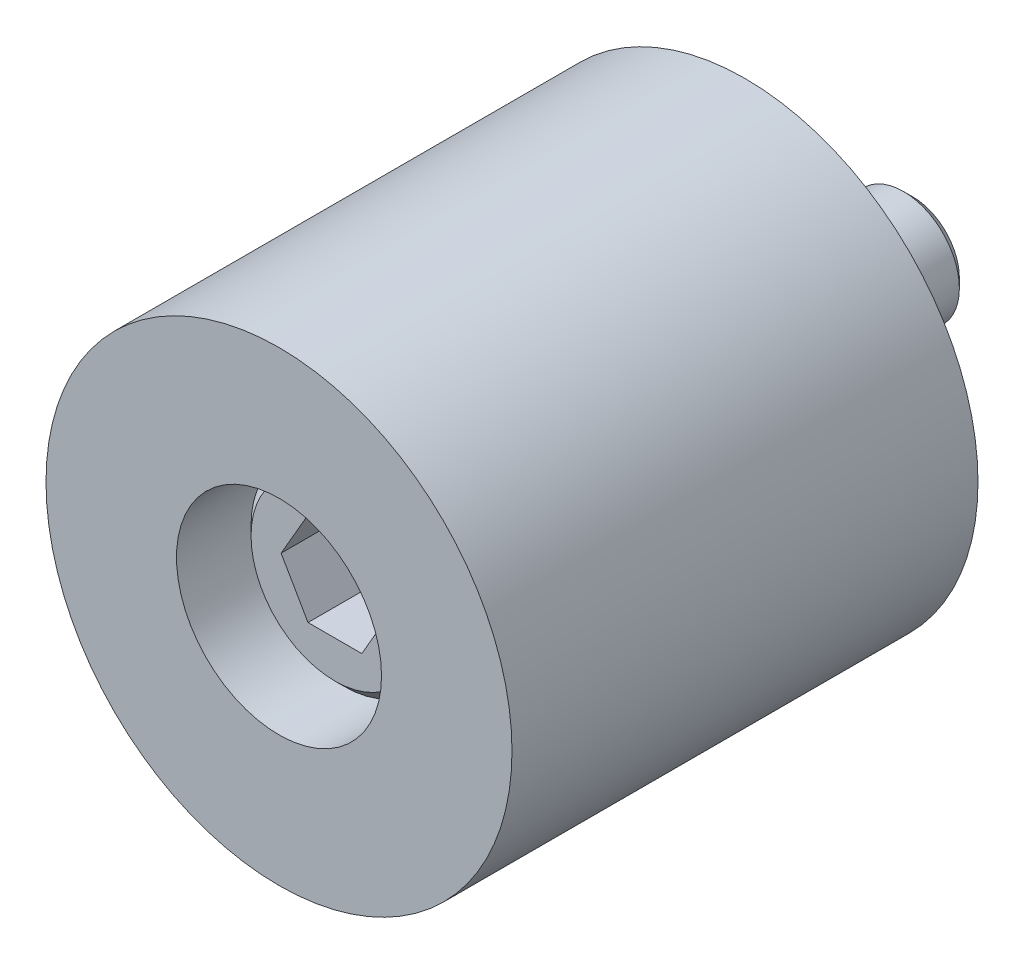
ISO-10303-21;
HEADER;
FILE_DESCRIPTION(('STEP AP214'),'2;1');
FILE_NAME('part.step','',(''),(''),'','','');
FILE_SCHEMA(('AUTOMOTIVE_DESIGN { 1 0 10303 214 1 1 1 1 }'));
ENDSEC;
DATA;
#1=APPLICATION_CONTEXT('core data for automotive mechanical design processes');
#2=APPLICATION_PROTOCOL_DEFINITION('international standard','automotive_design',2000,#1);
#3=PRODUCT_CONTEXT('',#1,'mechanical');
#4=PRODUCT('Part','Part','',(#3));
#5=PRODUCT_RELATED_PRODUCT_CATEGORY('part','',(#4));
#6=PRODUCT_DEFINITION_FORMATION('','',#4);
#7=PRODUCT_DEFINITION_CONTEXT('part definition',#1,'design');
#8=PRODUCT_DEFINITION('design','',#6,#7);
#9=PRODUCT_DEFINITION_SHAPE('','',#8);
#10=(LENGTH_UNIT() NAMED_UNIT(*) SI_UNIT(.MILLI.,.METRE.));
#11=(NAMED_UNIT(*) PLANE_ANGLE_UNIT() SI_UNIT($,.RADIAN.));
#12=(NAMED_UNIT(*) SI_UNIT($,.STERADIAN.) SOLID_ANGLE_UNIT());
#13=UNCERTAINTY_MEASURE_WITH_UNIT(LENGTH_MEASURE(1.E-05),#10,'distance_accuracy_value','');
#14=(GEOMETRIC_REPRESENTATION_CONTEXT(3) GLOBAL_UNCERTAINTY_ASSIGNED_CONTEXT((#13)) GLOBAL_UNIT_ASSIGNED_CONTEXT((#10,
#11,#12)) REPRESENTATION_CONTEXT('',''));
#15=CARTESIAN_POINT('',(0.,0.,0.));
#16=DIRECTION('',(0.,0.,1.));
#17=DIRECTION('',(1.,0.,0.));
#18=AXIS2_PLACEMENT_3D('',#15,#16,#17);
#19=CARTESIAN_POINT('',(0.,0.,12.5));
#20=DIRECTION('',(0.,0.,-1.));
#21=DIRECTION('',(1.,0.,0.));
#22=AXIS2_PLACEMENT_3D('',#19,#20,#21);
#23=CYLINDRICAL_SURFACE('',#22,3.25);
#24=CARTESIAN_POINT('',(0.,0.,16.));
#25=DIRECTION('',(0.,0.,1.));
#26=DIRECTION('',(-1.,0.,0.));
#27=AXIS2_PLACEMENT_3D('',#24,#25,#26);
#28=CIRCLE('',#27,3.25);
#29=CARTESIAN_POINT('',(-3.25,0.,16.));
#30=VERTEX_POINT('',#29);
#31=CARTESIAN_POINT('',(3.25,0.,16.));
#32=VERTEX_POINT('',#31);
#33=EDGE_CURVE('P0_E36',#30,#32,#28,.T.);
#34=ORIENTED_EDGE('',*,*,#33,.T.);
#35=CARTESIAN_POINT('',(3.25,0.,15.9999987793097));
#36=CARTESIAN_POINT('',(3.25,0.,-1.63686635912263E-06));
#37=B_SPLINE_CURVE_WITH_KNOTS('',1,(#35,#36),.UNSPECIFIED.,.F.,.F.,(2,2),(0.0833333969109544,
0.916666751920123),.UNSPECIFIED.);
#38=CARTESIAN_POINT('',(3.25,0.,0.));
#39=VERTEX_POINT('',#38);
#40=EDGE_CURVE('P0_E25',#32,#39,#37,.T.);
#41=ORIENTED_EDGE('',*,*,#40,.T.);
#42=CARTESIAN_POINT('',(0.,0.,0.));
#43=DIRECTION('',(0.,0.,1.));
#44=DIRECTION('',(1.,0.,0.));
#45=AXIS2_PLACEMENT_3D('',#42,#43,#44);
#46=CIRCLE('',#45,3.25);
#47=EDGE_CURVE('P0_E11',#39,#39,#46,.T.);
#48=ORIENTED_EDGE('',*,*,#47,.F.);
#49=ORIENTED_EDGE('',*,*,#40,.F.);
#50=CARTESIAN_POINT('',(0.,0.,16.));
#51=DIRECTION('',(0.,0.,1.));
#52=DIRECTION('',(-1.,0.,0.));
#53=AXIS2_PLACEMENT_3D('',#50,#51,#52);
#54=CIRCLE('',#53,3.25);
#55=EDGE_CURVE('P0_E51',#32,#30,#54,.T.);
#56=ORIENTED_EDGE('',*,*,#55,.T.);
#57=EDGE_LOOP('',(#34,#41,#48,#49,#56));
#58=FACE_BOUND('',#57,.T.);
#59=ADVANCED_FACE('P0_F16',(#58),#23,.F.);
#60=CARTESIAN_POINT('',(0.,0.,20.5));
#61=DIRECTION('',(0.,0.,-1.));
#62=DIRECTION('',(1.,0.,0.));
#63=AXIS2_PLACEMENT_3D('',#60,#61,#62);
#64=CYLINDRICAL_SURFACE('',#63,5.5);
#65=CARTESIAN_POINT('',(0.,0.,25.));
#66=DIRECTION('',(0.,0.,-1.));
#67=DIRECTION('',(1.,0.,0.));
#68=AXIS2_PLACEMENT_3D('',#65,#66,#67);
#69=CIRCLE('',#68,5.5);
#70=CARTESIAN_POINT('',(5.5,0.,25.));
#71=VERTEX_POINT('',#70);
#72=EDGE_CURVE('P0_E53',#71,#71,#69,.T.);
#73=ORIENTED_EDGE('',*,*,#72,.F.);
#74=CARTESIAN_POINT('',(5.5,0.,25.0000013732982));
#75=CARTESIAN_POINT('',(5.5,0.,15.9999982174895));
#76=B_SPLINE_CURVE_WITH_KNOTS('',1,(#74,#75),.UNSPECIFIED.,.F.,.F.,(2,2),(0.0833332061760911,
0.916666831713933),.UNSPECIFIED.);
#77=CARTESIAN_POINT('',(5.5,0.,16.));
#78=VERTEX_POINT('',#77);
#79=EDGE_CURVE('P0_E91',#71,#78,#76,.T.);
#80=ORIENTED_EDGE('',*,*,#79,.T.);
#81=CARTESIAN_POINT('',(0.,0.,16.));
#82=DIRECTION('',(0.,0.,-1.));
#83=DIRECTION('',(1.,0.,0.));
#84=AXIS2_PLACEMENT_3D('',#81,#82,#83);
#85=CIRCLE('',#84,5.5);
#86=EDGE_CURVE('P0_E94',#78,#78,#85,.T.);
#87=ORIENTED_EDGE('',*,*,#86,.T.);
#88=ORIENTED_EDGE('',*,*,#79,.F.);
#89=EDGE_LOOP('',(#73,#80,#87,#88));
#90=FACE_BOUND('',#89,.T.);
#91=ADVANCED_FACE('P0_F111',(#90),#64,.F.);
#92=CARTESIAN_POINT('',(-12.65,11.4315353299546,16.));
#93=DIRECTION('',(0.,0.,-1.));
#94=DIRECTION('',(1.,0.,0.));
#95=AXIS2_PLACEMENT_3D('',#92,#93,#94);
#96=PLANE('',#95);
#97=ORIENTED_EDGE('',*,*,#86,.F.);
#98=EDGE_LOOP('',(#97));
#99=FACE_BOUND('',#98,.T.);
#100=ORIENTED_EDGE('',*,*,#55,.F.);
#101=ORIENTED_EDGE('',*,*,#33,.F.);
#102=EDGE_LOOP('',(#100,#101));
#103=FACE_BOUND('',#102,.T.);
#104=ADVANCED_FACE('P0_F55',(#99,#103),#96,.F.);
#105=CARTESIAN_POINT('',(0.,0.,12.5));
#106=DIRECTION('',(0.,0.,1.));
#107=DIRECTION('',(1.,0.,0.));
#108=AXIS2_PLACEMENT_3D('',#105,#106,#107);
#109=CYLINDRICAL_SURFACE('',#108,12.5);
#110=CARTESIAN_POINT('',(0.,0.,0.));
#111=DIRECTION('',(0.,0.,-1.));
#112=DIRECTION('',(1.,0.,0.));
#113=AXIS2_PLACEMENT_3D('',#110,#111,#112);
#114=CIRCLE('',#113,12.5);
#115=CARTESIAN_POINT('',(12.5,0.,0.));
#116=VERTEX_POINT('',#115);
#117=EDGE_CURVE('P0_E85',#116,#116,#114,.T.);
#118=ORIENTED_EDGE('',*,*,#117,.F.);
#119=CARTESIAN_POINT('',(12.5,0.,-9.53694316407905E-07));
#120=CARTESIAN_POINT('',(12.5,0.,24.9999996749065));
#121=B_SPLINE_CURVE_WITH_KNOTS('',1,(#119,#120),.UNSPECIFIED.,.F.,.F.,(2,2),(0.0833333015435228,
0.916666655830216),.UNSPECIFIED.);
#122=CARTESIAN_POINT('',(12.5,0.,25.));
#123=VERTEX_POINT('',#122);
#124=EDGE_CURVE('P0_E57',#116,#123,#121,.T.);
#125=ORIENTED_EDGE('',*,*,#124,.T.);
#126=CARTESIAN_POINT('',(0.,0.,25.));
#127=DIRECTION('',(0.,0.,1.));
#128=DIRECTION('',(1.,0.,0.));
#129=AXIS2_PLACEMENT_3D('',#126,#127,#128);
#130=CIRCLE('',#129,12.5);
#131=EDGE_CURVE('P0_E82',#123,#123,#130,.T.);
#132=ORIENTED_EDGE('',*,*,#131,.F.);
#133=ORIENTED_EDGE('',*,*,#124,.F.);
#134=EDGE_LOOP('',(#118,#125,#132,#133));
#135=FACE_BOUND('',#134,.T.);
#136=ADVANCED_FACE('P0_F130',(#135),#109,.T.);
#137=CARTESIAN_POINT('',(16.25,-25.9807621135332,0.));
#138=DIRECTION('',(0.,0.,-1.));
#139=DIRECTION('',(-1.,0.,0.));
#140=AXIS2_PLACEMENT_3D('',#137,#138,#139);
#141=PLANE('',#140);
#142=ORIENTED_EDGE('',*,*,#117,.T.);
#143=EDGE_LOOP('',(#142));
#144=FACE_BOUND('',#143,.T.);
#145=ORIENTED_EDGE('',*,*,#47,.T.);
#146=EDGE_LOOP('',(#145));
#147=FACE_BOUND('',#146,.T.);
#148=ADVANCED_FACE('P0_F132',(#144,#147),#141,.T.);
#149=CARTESIAN_POINT('',(-28.75,-25.9807621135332,25.));
#150=DIRECTION('',(0.,0.,1.));
#151=DIRECTION('',(1.,0.,0.));
#152=AXIS2_PLACEMENT_3D('',#149,#150,#151);
#153=PLANE('',#152);
#154=ORIENTED_EDGE('',*,*,#131,.T.);
#155=EDGE_LOOP('',(#154));
#156=FACE_BOUND('',#155,.T.);
#157=ORIENTED_EDGE('',*,*,#72,.T.);
#158=EDGE_LOOP('',(#157));
#159=FACE_BOUND('',#158,.T.);
#160=ADVANCED_FACE('P0_F108',(#156,#159),#153,.T.);
#161=CLOSED_SHELL('',(#59,#91,#104,#136,#148,#160));
#162=MANIFOLD_SOLID_BREP('P0_B1',#161);
#163=CARTESIAN_POINT('',(0.,0.,-7.25735931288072));
#164=DIRECTION('',(0.,0.,1.));
#165=DIRECTION('',(-1.,0.,0.));
#166=AXIS2_PLACEMENT_3D('',#163,#164,#165);
#167=CONICAL_SURFACE('',#166,4.24264068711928,0.785398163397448);
#168=CARTESIAN_POINT('',(0.,0.,-9.));
#169=DIRECTION('',(0.,0.,1.));
#170=DIRECTION('',(1.,0.,0.));
#171=AXIS2_PLACEMENT_3D('',#168,#169,#170);
#172=CIRCLE('',#171,2.5);
#173=CARTESIAN_POINT('',(2.5,0.,-9.));
#174=VERTEX_POINT('',#173);
#175=CARTESIAN_POINT('',(-2.5,0.,-9.));
#176=VERTEX_POINT('',#175);
#177=EDGE_CURVE('P1_E37',#174,#176,#172,.T.);
#178=ORIENTED_EDGE('',*,*,#177,.T.);
#179=CARTESIAN_POINT('',(-2.49999945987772,0.,-9.00000054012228));
#180=CARTESIAN_POINT('',(-2.9999979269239,0.,-8.5000020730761));
#181=B_SPLINE_CURVE_WITH_KNOTS('',1,(#179,#180),.UNSPECIFIED.,.F.,.F.,(2,2),(0.589255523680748,
0.707106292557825),.UNSPECIFIED.);
#182=CARTESIAN_POINT('',(-3.,0.,-8.5));
#183=VERTEX_POINT('',#182);
#184=EDGE_CURVE('P1_E24',#176,#183,#181,.T.);
#185=ORIENTED_EDGE('',*,*,#184,.T.);
#186=CARTESIAN_POINT('',(0.,0.,-8.5));
#187=DIRECTION('',(0.,0.,-1.));
#188=DIRECTION('',(1.,0.,0.));
#189=AXIS2_PLACEMENT_3D('',#186,#187,#188);
#190=CIRCLE('',#189,3.);
#191=CARTESIAN_POINT('',(3.,0.,-8.5));
#192=VERTEX_POINT('',#191);
#193=EDGE_CURVE('P1_E173',#183,#192,#190,.T.);
#194=ORIENTED_EDGE('',*,*,#193,.T.);
#195=CARTESIAN_POINT('',(0.,0.,-8.5));
#196=DIRECTION('',(0.,0.,-1.));
#197=DIRECTION('',(1.,0.,0.));
#198=AXIS2_PLACEMENT_3D('',#195,#196,#197);
#199=CIRCLE('',#198,3.);
#200=EDGE_CURVE('P1_E10',#192,#183,#199,.T.);
#201=ORIENTED_EDGE('',*,*,#200,.T.);
#202=ORIENTED_EDGE('',*,*,#184,.F.);
#203=CARTESIAN_POINT('',(0.,0.,-9.));
#204=DIRECTION('',(0.,0.,1.));
#205=DIRECTION('',(1.,0.,0.));
#206=AXIS2_PLACEMENT_3D('',#203,#204,#205);
#207=CIRCLE('',#206,2.5);
#208=EDGE_CURVE('P1_E146',#176,#174,#207,.T.);
#209=ORIENTED_EDGE('',*,*,#208,.T.);
#210=EDGE_LOOP('',(#178,#185,#194,#201,#202,#209));
#211=FACE_BOUND('',#210,.T.);
#212=ADVANCED_FACE('P1_F15',(#211),#167,.T.);
#213=CARTESIAN_POINT('',(0.,0.,3.5));
#214=DIRECTION('',(0.,0.,-1.));
#215=DIRECTION('',(1.,0.,0.));
#216=AXIS2_PLACEMENT_3D('',#213,#214,#215);
#217=CYLINDRICAL_SURFACE('',#216,3.);
#218=CARTESIAN_POINT('',(0.,0.,16.));
#219=DIRECTION('',(0.,0.,1.));
#220=DIRECTION('',(1.,0.,0.));
#221=AXIS2_PLACEMENT_3D('',#218,#219,#220);
#222=CIRCLE('',#221,3.);
#223=CARTESIAN_POINT('',(3.,0.,16.));
#224=VERTEX_POINT('',#223);
#225=EDGE_CURVE('P1_E154',#224,#224,#222,.T.);
#226=ORIENTED_EDGE('',*,*,#225,.F.);
#227=CARTESIAN_POINT('',(3.,0.,16.0000009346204));
#228=CARTESIAN_POINT('',(3.,0.,-8.49999968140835));
#229=B_SPLINE_CURVE_WITH_KNOTS('',1,(#227,#228),.UNSPECIFIED.,.F.,.F.,(2,2),(0.0833333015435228,
0.916666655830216),.UNSPECIFIED.);
#230=EDGE_CURVE('P1_E127',#224,#192,#229,.T.);
#231=ORIENTED_EDGE('',*,*,#230,.T.);
#232=ORIENTED_EDGE('',*,*,#193,.F.);
#233=ORIENTED_EDGE('',*,*,#200,.F.);
#234=ORIENTED_EDGE('',*,*,#230,.F.);
#235=EDGE_LOOP('',(#226,#231,#232,#233,#234));
#236=FACE_BOUND('',#235,.T.);
#237=ADVANCED_FACE('P1_F337',(#236),#217,.T.);
#238=CARTESIAN_POINT('',(-5.75,5.19615242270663,-9.));
#239=DIRECTION('',(0.,0.,-1.));
#240=DIRECTION('',(1.,0.,0.));
#241=AXIS2_PLACEMENT_3D('',#238,#239,#240);
#242=PLANE('',#241);
#243=ORIENTED_EDGE('',*,*,#208,.F.);
#244=ORIENTED_EDGE('',*,*,#177,.F.);
#245=EDGE_LOOP('',(#243,#244));
#246=FACE_BOUND('',#245,.T.);
#247=ADVANCED_FACE('P1_F340',(#246),#242,.T.);
#248=CARTESIAN_POINT('',(0.,0.,19.4289321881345));
#249=DIRECTION('',(0.,0.,-1.));
#250=DIRECTION('',(-1.,0.,0.));
#251=AXIS2_PLACEMENT_3D('',#248,#249,#250);
#252=CONICAL_SURFACE('',#251,7.07106781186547,0.785398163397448);
#253=CARTESIAN_POINT('',(0.,0.,22.));
#254=DIRECTION('',(0.,0.,-1.));
#255=DIRECTION('',(1.,0.,0.));
#256=AXIS2_PLACEMENT_3D('',#253,#254,#255);
#257=CIRCLE('',#256,4.5);
#258=CARTESIAN_POINT('',(4.5,0.,22.));
#259=VERTEX_POINT('',#258);
#260=CARTESIAN_POINT('',(-4.5,0.,22.));
#261=VERTEX_POINT('',#260);
#262=EDGE_CURVE('P1_E102',#259,#261,#257,.T.);
#263=ORIENTED_EDGE('',*,*,#262,.T.);
#264=CARTESIAN_POINT('',(-4.50000215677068,0.,21.9999978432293));
#265=CARTESIAN_POINT('',(-5.00000242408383,0.,21.4999975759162));
#266=B_SPLINE_CURVE_WITH_KNOTS('',1,(#264,#265),.UNSPECIFIED.,.F.,.F.,(2,2),(0.636396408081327,
0.70710712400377),.UNSPECIFIED.);
#267=CARTESIAN_POINT('',(-5.,0.,21.5));
#268=VERTEX_POINT('',#267);
#269=EDGE_CURVE('P1_E107',#261,#268,#266,.T.);
#270=ORIENTED_EDGE('',*,*,#269,.T.);
#271=CARTESIAN_POINT('',(0.,0.,21.5));
#272=DIRECTION('',(0.,0.,1.));
#273=DIRECTION('',(1.,0.,0.));
#274=AXIS2_PLACEMENT_3D('',#271,#272,#273);
#275=CIRCLE('',#274,5.);
#276=CARTESIAN_POINT('',(5.,0.,21.5));
#277=VERTEX_POINT('',#276);
#278=EDGE_CURVE('P1_E117',#268,#277,#275,.T.);
#279=ORIENTED_EDGE('',*,*,#278,.T.);
#280=CARTESIAN_POINT('',(0.,0.,21.5));
#281=DIRECTION('',(0.,0.,1.));
#282=DIRECTION('',(1.,0.,0.));
#283=AXIS2_PLACEMENT_3D('',#280,#281,#282);
#284=CIRCLE('',#283,5.);
#285=EDGE_CURVE('P1_E119',#277,#268,#284,.T.);
#286=ORIENTED_EDGE('',*,*,#285,.T.);
#287=ORIENTED_EDGE('',*,*,#269,.F.);
#288=CARTESIAN_POINT('',(0.,0.,22.));
#289=DIRECTION('',(0.,0.,-1.));
#290=DIRECTION('',(1.,0.,0.));
#291=AXIS2_PLACEMENT_3D('',#288,#289,#290);
#292=CIRCLE('',#291,4.5);
#293=EDGE_CURVE('P1_E109',#261,#259,#292,.T.);
#294=ORIENTED_EDGE('',*,*,#293,.T.);
#295=EDGE_LOOP('',(#263,#270,#279,#286,#287,#294));
#296=FACE_BOUND('',#295,.T.);
#297=ADVANCED_FACE('P1_F104',(#296),#252,.T.);
#298=CARTESIAN_POINT('',(0.,0.,19.));
#299=DIRECTION('',(0.,0.,1.));
#300=DIRECTION('',(1.,0.,0.));
#301=AXIS2_PLACEMENT_3D('',#298,#299,#300);
#302=CYLINDRICAL_SURFACE('',#301,5.);
#303=CARTESIAN_POINT('',(0.,0.,16.));
#304=DIRECTION('',(0.,0.,-1.));
#305=DIRECTION('',(1.,0.,0.));
#306=AXIS2_PLACEMENT_3D('',#303,#304,#305);
#307=CIRCLE('',#306,5.);
#308=CARTESIAN_POINT('',(5.,0.,16.));
#309=VERTEX_POINT('',#308);
#310=EDGE_CURVE('P1_E112',#309,#309,#307,.T.);
#311=ORIENTED_EDGE('',*,*,#310,.F.);
#312=CARTESIAN_POINT('',(5.,0.,16.000004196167));
#313=CARTESIAN_POINT('',(5.,0.,21.5000028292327));
#314=B_SPLINE_CURVE_WITH_KNOTS('',1,(#312,#313),.UNSPECIFIED.,.F.,.F.,(2,2),(0.0833339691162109,
0.916667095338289),.UNSPECIFIED.);
#315=EDGE_CURVE('P1_E317',#309,#277,#314,.T.);
#316=ORIENTED_EDGE('',*,*,#315,.T.);
#317=ORIENTED_EDGE('',*,*,#278,.F.);
#318=ORIENTED_EDGE('',*,*,#285,.F.);
#319=ORIENTED_EDGE('',*,*,#315,.F.);
#320=EDGE_LOOP('',(#311,#316,#317,#318,#319));
#321=FACE_BOUND('',#320,.T.);
#322=ADVANCED_FACE('P1_F348',(#321),#302,.T.);
#323=CARTESIAN_POINT('',(-10.35,-9.35307436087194,22.));
#324=DIRECTION('',(0.,0.,1.));
#325=DIRECTION('',(1.,0.,0.));
#326=AXIS2_PLACEMENT_3D('',#323,#324,#325);
#327=PLANE('',#326);
#328=ORIENTED_EDGE('',*,*,#293,.F.);
#329=ORIENTED_EDGE('',*,*,#262,.F.);
#330=EDGE_LOOP('',(#328,#329));
#331=FACE_BOUND('',#330,.T.);
#332=DIRECTION('',(-0.500000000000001,0.866025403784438,0.));
#333=VECTOR('',#332,1.);
#334=CARTESIAN_POINT('',(-1.44337567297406,-2.5,22.));
#335=LINE('',#334,#333);
#336=CARTESIAN_POINT('',(-1.44337567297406,-2.5,22.));
#337=VERTEX_POINT('',#336);
#338=CARTESIAN_POINT('',(-2.88675134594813,0.,22.));
#339=VERTEX_POINT('',#338);
#340=EDGE_CURVE('P1_E312',#337,#339,#335,.T.);
#341=ORIENTED_EDGE('',*,*,#340,.T.);
#342=DIRECTION('',(0.5,0.866025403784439,0.));
#343=VECTOR('',#342,1.);
#344=CARTESIAN_POINT('',(-2.88675134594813,0.,22.));
#345=LINE('',#344,#343);
#346=CARTESIAN_POINT('',(-1.44337567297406,2.5,22.));
#347=VERTEX_POINT('',#346);
#348=EDGE_CURVE('P1_E306',#339,#347,#345,.T.);
#349=ORIENTED_EDGE('',*,*,#348,.T.);
#350=DIRECTION('',(1.,0.,0.));
#351=VECTOR('',#350,1.);
#352=CARTESIAN_POINT('',(-1.44337567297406,2.5,22.));
#353=LINE('',#352,#351);
#354=CARTESIAN_POINT('',(1.44337567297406,2.5,22.));
#355=VERTEX_POINT('',#354);
#356=EDGE_CURVE('P1_E300',#347,#355,#353,.T.);
#357=ORIENTED_EDGE('',*,*,#356,.T.);
#358=DIRECTION('',(0.500000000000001,-0.866025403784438,0.));
#359=VECTOR('',#358,1.);
#360=CARTESIAN_POINT('',(1.44337567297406,2.5,22.));
#361=LINE('',#360,#359);
#362=CARTESIAN_POINT('',(2.88675134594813,0.,22.));
#363=VERTEX_POINT('',#362);
#364=EDGE_CURVE('P1_E294',#355,#363,#361,.T.);
#365=ORIENTED_EDGE('',*,*,#364,.T.);
#366=DIRECTION('',(-0.499999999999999,-0.866025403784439,0.));
#367=VECTOR('',#366,1.);
#368=CARTESIAN_POINT('',(2.88675134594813,0.,22.));
#369=LINE('',#368,#367);
#370=CARTESIAN_POINT('',(1.44337567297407,-2.5,22.));
#371=VERTEX_POINT('',#370);
#372=EDGE_CURVE('P1_E288',#363,#371,#369,.T.);
#373=ORIENTED_EDGE('',*,*,#372,.T.);
#374=DIRECTION('',(-1.,0.,0.));
#375=VECTOR('',#374,1.);
#376=CARTESIAN_POINT('',(1.44337567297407,-2.5,22.));
#377=LINE('',#376,#375);
#378=EDGE_CURVE('P1_E277',#371,#337,#377,.T.);
#379=ORIENTED_EDGE('',*,*,#378,.T.);
#380=EDGE_LOOP('',(#341,#349,#357,#365,#373,#379));
#381=FACE_BOUND('',#380,.T.);
#382=ADVANCED_FACE('P1_F114',(#331,#381),#327,.T.);
#383=CARTESIAN_POINT('',(0.,0.,19.5600391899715));
#384=DIRECTION('',(0.,0.,1.));
#385=DIRECTION('',(-1.,0.,0.));
#386=AXIS2_PLACEMENT_3D('',#383,#384,#385);
#387=CONICAL_SURFACE('',#386,3.81881307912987,1.02974425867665);
#388=CARTESIAN_POINT('',(0.,0.,17.275464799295));
#389=DIRECTION('',(0.,0.,-1.));
#390=DIRECTION('',(-1.,0.,0.));
#391=AXIS2_PLACEMENT_3D('',#388,#389,#390);
#392=CIRCLE('',#391,0.0166427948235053);
#393=CARTESIAN_POINT('',(-0.0166427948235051,0.,17.275464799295));
#394=VERTEX_POINT('',#393);
#395=EDGE_CURVE('P1_E216',#394,#394,#392,.T.);
#396=ORIENTED_EDGE('',*,*,#395,.T.);
#397=CARTESIAN_POINT('',(-0.0166398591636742,0.,17.2754630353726));
#398=CARTESIAN_POINT('',(-2.88675167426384,0.,19.000000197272));
#399=B_SPLINE_CURVE_WITH_KNOTS('',1,(#397,#398),.UNSPECIFIED.,.F.,.F.,(2,2),(0.0043573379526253,
0.755929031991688),.UNSPECIFIED.);
#400=CARTESIAN_POINT('',(-2.88675134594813,0.,19.));
#401=VERTEX_POINT('',#400);
#402=EDGE_CURVE('P1_E221',#394,#401,#399,.T.);
#403=ORIENTED_EDGE('',*,*,#402,.T.);
#404=CARTESIAN_POINT('',(-2.88675134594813,0.,19.));
#405=CARTESIAN_POINT('',(-2.1650635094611,-1.25,18.5663661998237));
#406=CARTESIAN_POINT('',(-1.44337567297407,-2.5,19.));
#407=(BOUNDED_CURVE() B_SPLINE_CURVE(2,(#404,#405,#406),.UNSPECIFIED.,.F.,
.F.) B_SPLINE_CURVE_WITH_KNOTS((3,3),(0.,2.92392578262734),
.UNSPECIFIED.) CURVE() GEOMETRIC_REPRESENTATION_ITEM() RATIONAL_B_SPLINE_CURVE((1.,
1.15470053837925,1.)) REPRESENTATION_ITEM(''));
#408=CARTESIAN_POINT('',(-1.44337567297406,-2.5,19.));
#409=VERTEX_POINT('',#408);
#410=EDGE_CURVE('P1_E227',#401,#409,#407,.T.);
#411=ORIENTED_EDGE('',*,*,#410,.T.);
#412=CARTESIAN_POINT('',(-1.44337567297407,-2.5,19.));
#413=CARTESIAN_POINT('',(0.,-2.5,18.5663661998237));
#414=CARTESIAN_POINT('',(1.44337567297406,-2.5,19.));
#415=(BOUNDED_CURVE() B_SPLINE_CURVE(2,(#412,#413,#414),.UNSPECIFIED.,.F.,
.F.) B_SPLINE_CURVE_WITH_KNOTS((3,3),(0.,2.92392578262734),
.UNSPECIFIED.) CURVE() GEOMETRIC_REPRESENTATION_ITEM() RATIONAL_B_SPLINE_CURVE((1.,
1.15470053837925,1.)) REPRESENTATION_ITEM(''));
#416=CARTESIAN_POINT('',(1.44337567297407,-2.5,19.));
#417=VERTEX_POINT('',#416);
#418=EDGE_CURVE('P1_E224',#409,#417,#415,.T.);
#419=ORIENTED_EDGE('',*,*,#418,.T.);
#420=CARTESIAN_POINT('',(1.44337567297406,-2.5,19.));
#421=CARTESIAN_POINT('',(2.16506350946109,-1.25,18.5663661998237));
#422=CARTESIAN_POINT('',(2.88675134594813,0.,19.));
#423=(BOUNDED_CURVE() B_SPLINE_CURVE(2,(#420,#421,#422),.UNSPECIFIED.,.F.,
.F.) B_SPLINE_CURVE_WITH_KNOTS((3,3),(0.,2.92392578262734),
.UNSPECIFIED.) CURVE() GEOMETRIC_REPRESENTATION_ITEM() RATIONAL_B_SPLINE_CURVE((1.,
1.15470053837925,1.)) REPRESENTATION_ITEM(''));
#424=CARTESIAN_POINT('',(2.88675134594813,0.,19.));
#425=VERTEX_POINT('',#424);
#426=EDGE_CURVE('P1_E267',#417,#425,#423,.T.);
#427=ORIENTED_EDGE('',*,*,#426,.T.);
#428=CARTESIAN_POINT('',(2.88675134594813,0.,19.));
#429=CARTESIAN_POINT('',(2.1650635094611,1.25,18.5663661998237));
#430=CARTESIAN_POINT('',(1.44337567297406,2.5,19.));
#431=(BOUNDED_CURVE() B_SPLINE_CURVE(2,(#428,#429,#430),.UNSPECIFIED.,.F.,
.F.) B_SPLINE_CURVE_WITH_KNOTS((3,3),(0.,2.92392578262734),
.UNSPECIFIED.) CURVE() GEOMETRIC_REPRESENTATION_ITEM() RATIONAL_B_SPLINE_CURVE((1.,
1.15470053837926,1.)) REPRESENTATION_ITEM(''));
#432=CARTESIAN_POINT('',(1.44337567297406,2.5,19.));
#433=VERTEX_POINT('',#432);
#434=EDGE_CURVE('P1_E257',#425,#433,#431,.T.);
#435=ORIENTED_EDGE('',*,*,#434,.T.);
#436=CARTESIAN_POINT('',(1.44337567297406,2.5,19.));
#437=CARTESIAN_POINT('',(0.,2.5,18.5663661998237));
#438=CARTESIAN_POINT('',(-1.44337567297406,2.5,19.));
#439=(BOUNDED_CURVE() B_SPLINE_CURVE(2,(#436,#437,#438),.UNSPECIFIED.,.F.,
.F.) B_SPLINE_CURVE_WITH_KNOTS((3,3),(0.,2.92392578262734),
.UNSPECIFIED.) CURVE() GEOMETRIC_REPRESENTATION_ITEM() RATIONAL_B_SPLINE_CURVE((1.,
1.15470053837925,1.)) REPRESENTATION_ITEM(''));
#440=CARTESIAN_POINT('',(-1.44337567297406,2.5,19.));
#441=VERTEX_POINT('',#440);
#442=EDGE_CURVE('P1_E247',#433,#441,#439,.T.);
#443=ORIENTED_EDGE('',*,*,#442,.T.);
#444=CARTESIAN_POINT('',(-1.44337567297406,2.5,19.));
#445=CARTESIAN_POINT('',(-2.1650635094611,1.25,18.5663661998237));
#446=CARTESIAN_POINT('',(-2.88675134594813,0.,19.));
#447=(BOUNDED_CURVE() B_SPLINE_CURVE(2,(#444,#445,#446),.UNSPECIFIED.,.F.,
.F.) B_SPLINE_CURVE_WITH_KNOTS((3,3),(0.,2.92392578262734),
.UNSPECIFIED.) CURVE() GEOMETRIC_REPRESENTATION_ITEM() RATIONAL_B_SPLINE_CURVE((1.,
1.15470053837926,1.)) REPRESENTATION_ITEM(''));
#448=EDGE_CURVE('P1_E237',#441,#401,#447,.T.);
#449=ORIENTED_EDGE('',*,*,#448,.T.);
#450=ORIENTED_EDGE('',*,*,#402,.F.);
#451=EDGE_LOOP('',(#396,#403,#411,#419,#427,#435,#443,#449,#450));
#452=FACE_BOUND('',#451,.T.);
#453=ADVANCED_FACE('P1_F390',(#452),#387,.F.);
#454=CARTESIAN_POINT('',(0.0382784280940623,-0.0345913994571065,17.275464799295));
#455=DIRECTION('',(0.,0.,-1.));
#456=DIRECTION('',(-1.,0.,0.));
#457=AXIS2_PLACEMENT_3D('',#454,#455,#456);
#458=PLANE('',#457);
#459=ORIENTED_EDGE('',*,*,#395,.F.);
#460=EDGE_LOOP('',(#459));
#461=FACE_BOUND('',#460,.T.);
#462=ADVANCED_FACE('P1_F398',(#461),#458,.F.);
#463=CARTESIAN_POINT('',(-1.29903810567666,-2.75,22.3433633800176));
#464=DIRECTION('',(-0.866025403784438,-0.5,0.));
#465=DIRECTION('',(-0.5,0.866025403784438,0.));
#466=AXIS2_PLACEMENT_3D('',#463,#464,#465);
#467=PLANE('',#466);
#468=DIRECTION('',(0.,0.,-1.));
#469=VECTOR('',#468,1.);
#470=CARTESIAN_POINT('',(-2.88675134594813,0.,22.));
#471=LINE('',#470,#469);
#472=EDGE_CURVE('P1_E210',#339,#401,#471,.T.);
#473=ORIENTED_EDGE('',*,*,#472,.F.);
#474=ORIENTED_EDGE('',*,*,#340,.F.);
#475=DIRECTION('',(0.,0.,-1.));
#476=VECTOR('',#475,1.);
#477=CARTESIAN_POINT('',(-1.44337567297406,-2.5,22.));
#478=LINE('',#477,#476);
#479=EDGE_CURVE('P1_E204',#337,#409,#478,.T.);
#480=ORIENTED_EDGE('',*,*,#479,.T.);
#481=ORIENTED_EDGE('',*,*,#410,.F.);
#482=EDGE_LOOP('',(#473,#474,#480,#481));
#483=FACE_BOUND('',#482,.T.);
#484=ADVANCED_FACE('P1_F407',(#483),#467,.F.);
#485=CARTESIAN_POINT('',(1.73205080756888,-2.5,22.3433633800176));
#486=DIRECTION('',(0.,-1.,0.));
#487=DIRECTION('',(-1.,0.,0.));
#488=AXIS2_PLACEMENT_3D('',#485,#486,#487);
#489=PLANE('',#488);
#490=ORIENTED_EDGE('',*,*,#479,.F.);
#491=ORIENTED_EDGE('',*,*,#378,.F.);
#492=DIRECTION('',(0.,0.,-1.));
#493=VECTOR('',#492,1.);
#494=CARTESIAN_POINT('',(1.44337567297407,-2.5,22.));
#495=LINE('',#494,#493);
#496=EDGE_CURVE('P1_E198',#371,#417,#495,.T.);
#497=ORIENTED_EDGE('',*,*,#496,.T.);
#498=ORIENTED_EDGE('',*,*,#418,.F.);
#499=EDGE_LOOP('',(#490,#491,#497,#498));
#500=FACE_BOUND('',#499,.T.);
#501=ADVANCED_FACE('P1_F416',(#500),#489,.F.);
#502=CARTESIAN_POINT('',(3.03108891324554,0.250000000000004,22.3433633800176));
#503=DIRECTION('',(0.866025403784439,-0.499999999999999,0.));
#504=DIRECTION('',(-0.499999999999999,-0.866025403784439,0.));
#505=AXIS2_PLACEMENT_3D('',#502,#503,#504);
#506=PLANE('',#505);
#507=ORIENTED_EDGE('',*,*,#496,.F.);
#508=ORIENTED_EDGE('',*,*,#372,.F.);
#509=DIRECTION('',(0.,0.,-1.));
#510=VECTOR('',#509,1.);
#511=CARTESIAN_POINT('',(2.88675134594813,0.,22.));
#512=LINE('',#511,#510);
#513=EDGE_CURVE('P1_E192',#363,#425,#512,.T.);
#514=ORIENTED_EDGE('',*,*,#513,.T.);
#515=ORIENTED_EDGE('',*,*,#426,.F.);
#516=EDGE_LOOP('',(#507,#508,#514,#515));
#517=FACE_BOUND('',#516,.T.);
#518=ADVANCED_FACE('P1_F425',(#517),#506,.F.);
#519=CARTESIAN_POINT('',(1.29903810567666,2.75,22.3433633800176));
#520=DIRECTION('',(0.866025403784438,0.500000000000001,0.));
#521=DIRECTION('',(0.500000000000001,-0.866025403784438,0.));
#522=AXIS2_PLACEMENT_3D('',#519,#520,#521);
#523=PLANE('',#522);
#524=ORIENTED_EDGE('',*,*,#513,.F.);
#525=ORIENTED_EDGE('',*,*,#364,.F.);
#526=DIRECTION('',(0.,0.,-1.));
#527=VECTOR('',#526,1.);
#528=CARTESIAN_POINT('',(1.44337567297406,2.5,22.));
#529=LINE('',#528,#527);
#530=EDGE_CURVE('P1_E186',#355,#433,#529,.T.);
#531=ORIENTED_EDGE('',*,*,#530,.T.);
#532=ORIENTED_EDGE('',*,*,#434,.F.);
#533=EDGE_LOOP('',(#524,#525,#531,#532));
#534=FACE_BOUND('',#533,.T.);
#535=ADVANCED_FACE('P1_F434',(#534),#523,.F.);
#536=CARTESIAN_POINT('',(-1.73205080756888,2.5,22.3433633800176));
#537=DIRECTION('',(0.,1.,0.));
#538=DIRECTION('',(1.,0.,0.));
#539=AXIS2_PLACEMENT_3D('',#536,#537,#538);
#540=PLANE('',#539);
#541=ORIENTED_EDGE('',*,*,#530,.F.);
#542=ORIENTED_EDGE('',*,*,#356,.F.);
#543=DIRECTION('',(0.,0.,-1.));
#544=VECTOR('',#543,1.);
#545=CARTESIAN_POINT('',(-1.44337567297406,2.5,22.));
#546=LINE('',#545,#544);
#547=EDGE_CURVE('P1_E178',#347,#441,#546,.T.);
#548=ORIENTED_EDGE('',*,*,#547,.T.);
#549=ORIENTED_EDGE('',*,*,#442,.F.);
#550=EDGE_LOOP('',(#541,#542,#548,#549));
#551=FACE_BOUND('',#550,.T.);
#552=ADVANCED_FACE('P1_F443',(#551),#540,.F.);
#553=CARTESIAN_POINT('',(-3.03108891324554,-0.250000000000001,22.3433633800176));
#554=DIRECTION('',(-0.866025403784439,0.5,0.));
#555=DIRECTION('',(0.5,0.866025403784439,0.));
#556=AXIS2_PLACEMENT_3D('',#553,#554,#555);
#557=PLANE('',#556);
#558=ORIENTED_EDGE('',*,*,#547,.F.);
#559=ORIENTED_EDGE('',*,*,#348,.F.);
#560=ORIENTED_EDGE('',*,*,#472,.T.);
#561=ORIENTED_EDGE('',*,*,#448,.F.);
#562=EDGE_LOOP('',(#558,#559,#560,#561));
#563=FACE_BOUND('',#562,.T.);
#564=ADVANCED_FACE('P1_F452',(#563),#557,.F.);
#565=CARTESIAN_POINT('',(6.5,-10.3923048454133,16.));
#566=DIRECTION('',(0.,0.,-1.));
#567=DIRECTION('',(-1.,0.,0.));
#568=AXIS2_PLACEMENT_3D('',#565,#566,#567);
#569=PLANE('',#568);
#570=ORIENTED_EDGE('',*,*,#310,.T.);
#571=EDGE_LOOP('',(#570));
#572=FACE_BOUND('',#571,.T.);
#573=ORIENTED_EDGE('',*,*,#225,.T.);
#574=EDGE_LOOP('',(#573));
#575=FACE_BOUND('',#574,.T.);
#576=ADVANCED_FACE('P1_F336',(#572,#575),#569,.T.);
#577=CLOSED_SHELL('',(#212,#237,#247,#297,#322,#382,#453,#462,#484,#501,#518,#535,#552,#564,#576));
#578=MANIFOLD_SOLID_BREP('P1_B1',#577);
#579=ADVANCED_BREP_SHAPE_REPRESENTATION('',(#18,#162,#578),#14);
#580=SHAPE_DEFINITION_REPRESENTATION(#9,#579);
ENDSEC;
END-ISO-10303-21;
